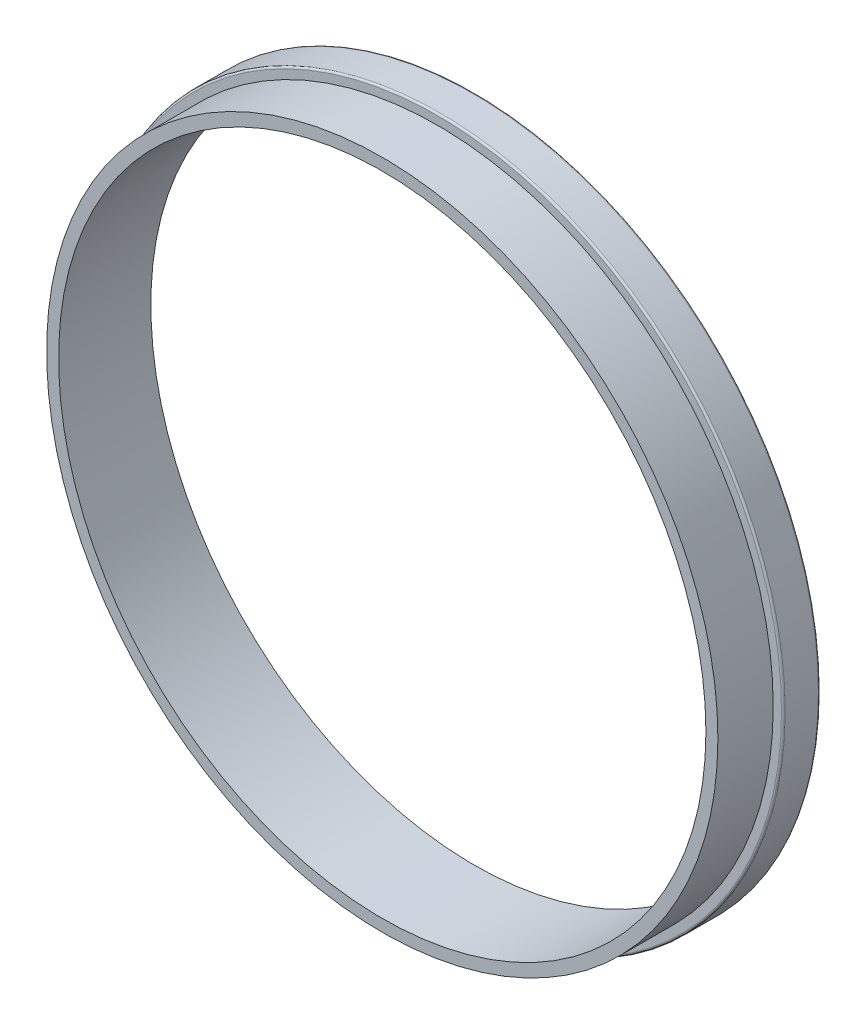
from build123d import *

# Parameters (mm, degrees)
SKETCH_1_R          = 37.5
SKETCH_1_R_2        = 35.1
EXTRUDE_1_DEPTH     = 10
SKETCH_2_OUTSIDE_W  = 98.308
SKETCH_2_OUTSIDE_H  = 98.308
SKETCH_2_OUTSIDE_R  = 36.4
CUT_EXTRUDE_1_DEPTH = 6
FILLET_1_R          = 0.2


with BuildPart() as part:
    # Sketch 1 → Extrude 1 (new body)
    with BuildSketch(Plane.XY):
        Circle(SKETCH_1_R)
        Circle(SKETCH_1_R_2, mode=Mode.SUBTRACT)
    extrude(amount=EXTRUDE_1_DEPTH)

    # Sketch 2 outside → Cut-Extrude 1 (cut)
    with BuildSketch(Plane.XY.offset(10)):
        Rectangle(SKETCH_2_OUTSIDE_W, SKETCH_2_OUTSIDE_H)
        Circle(SKETCH_2_OUTSIDE_R, mode=Mode.SUBTRACT)
    extrude(amount=-CUT_EXTRUDE_1_DEPTH, mode=Mode.SUBTRACT)

    # Fillet 1
    fillet_1_edges = [part.edges().sort_by_distance(p)[0] for p in [
        (-37.5, 0, 4),
        (-37.5, 0, 0),
    ]]
    fillet(fillet_1_edges, radius=FILLET_1_R)


solid = part.part
